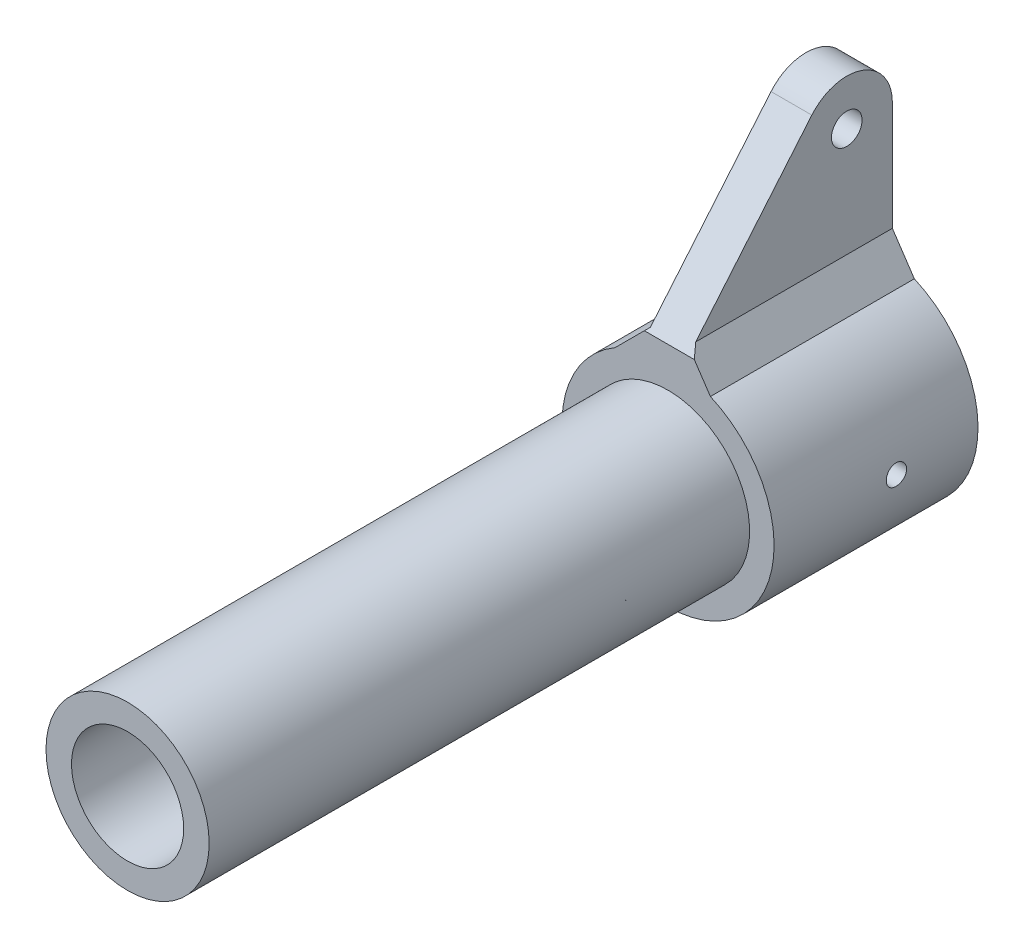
ISO-10303-21;
HEADER;
FILE_DESCRIPTION(('STEP AP214'),'2;1');
FILE_NAME('part.step','',(''),(''),'','','');
FILE_SCHEMA(('AUTOMOTIVE_DESIGN { 1 0 10303 214 1 1 1 1 }'));
ENDSEC;
DATA;
#1=APPLICATION_CONTEXT('core data for automotive mechanical design processes');
#2=APPLICATION_PROTOCOL_DEFINITION('international standard','automotive_design',2000,#1);
#3=PRODUCT_CONTEXT('',#1,'mechanical');
#4=PRODUCT('Part','Part','',(#3));
#5=PRODUCT_RELATED_PRODUCT_CATEGORY('part','',(#4));
#6=PRODUCT_DEFINITION_FORMATION('','',#4);
#7=PRODUCT_DEFINITION_CONTEXT('part definition',#1,'design');
#8=PRODUCT_DEFINITION('design','',#6,#7);
#9=PRODUCT_DEFINITION_SHAPE('','',#8);
#10=(LENGTH_UNIT() NAMED_UNIT(*) SI_UNIT(.MILLI.,.METRE.));
#11=(NAMED_UNIT(*) PLANE_ANGLE_UNIT() SI_UNIT($,.RADIAN.));
#12=(NAMED_UNIT(*) SI_UNIT($,.STERADIAN.) SOLID_ANGLE_UNIT());
#13=UNCERTAINTY_MEASURE_WITH_UNIT(LENGTH_MEASURE(1.E-05),#10,'distance_accuracy_value','');
#14=(GEOMETRIC_REPRESENTATION_CONTEXT(3) GLOBAL_UNCERTAINTY_ASSIGNED_CONTEXT((#13)) GLOBAL_UNIT_ASSIGNED_CONTEXT((#10,
#11,#12)) REPRESENTATION_CONTEXT('',''));
#15=CARTESIAN_POINT('',(0.,0.,0.));
#16=DIRECTION('',(0.,0.,1.));
#17=DIRECTION('',(1.,0.,0.));
#18=AXIS2_PLACEMENT_3D('',#15,#16,#17);
#19=CARTESIAN_POINT('',(0.,0.,10.));
#20=DIRECTION('',(0.,0.,-1.));
#21=DIRECTION('',(-1.,0.,0.));
#22=AXIS2_PLACEMENT_3D('',#19,#20,#21);
#23=CYLINDRICAL_SURFACE('',#22,5.2);
#24=CARTESIAN_POINT('',(-5.2,0.,4.5));
#25=CARTESIAN_POINT('',(-5.19999968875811,-0.0280158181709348,4.49999878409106));
#26=CARTESIAN_POINT('',(-5.19977118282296,-0.056050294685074,4.49763741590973));
#27=CARTESIAN_POINT('',(-5.19888159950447,-0.111342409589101,4.4882528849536));
#28=CARTESIAN_POINT('',(-5.1982200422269,-0.13859915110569,4.48122455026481));
#29=CARTESIAN_POINT('',(-5.19653905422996,-0.191527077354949,4.46271224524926));
#30=CARTESIAN_POINT('',(-5.19551983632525,-0.217199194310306,4.45123092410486));
#31=CARTESIAN_POINT('',(-5.19323757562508,-0.266246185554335,4.42414360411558));
#32=CARTESIAN_POINT('',(-5.19197458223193,-0.289621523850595,4.40853844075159));
#33=CARTESIAN_POINT('',(-5.18934159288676,-0.333495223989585,4.37359040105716));
#34=CARTESIAN_POINT('',(-5.18797129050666,-0.353984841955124,4.35423656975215));
#35=CARTESIAN_POINT('',(-5.18528066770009,-0.391430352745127,4.31236390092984));
#36=CARTESIAN_POINT('',(-5.18396034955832,-0.408386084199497,4.28984491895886));
#37=CARTESIAN_POINT('',(-5.18151601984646,-0.438313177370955,4.24222684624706));
#38=CARTESIAN_POINT('',(-5.18039239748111,-0.451276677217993,4.21712279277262));
#39=CARTESIAN_POINT('',(-5.17847241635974,-0.472801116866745,4.16508164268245));
#40=CARTESIAN_POINT('',(-5.17767605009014,-0.48136215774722,4.13814458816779));
#41=CARTESIAN_POINT('',(-5.17650347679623,-0.493812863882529,4.08329092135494));
#42=CARTESIAN_POINT('',(-5.17612597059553,-0.497716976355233,4.05537761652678));
#43=CARTESIAN_POINT('',(-5.17582981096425,-0.500787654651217,3.99928957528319));
#44=CARTESIAN_POINT('',(-5.17591114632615,-0.499954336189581,3.97111484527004));
#45=CARTESIAN_POINT('',(-5.17652229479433,-0.493585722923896,3.91540317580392));
#46=CARTESIAN_POINT('',(-5.17705060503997,-0.488066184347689,3.88786441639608));
#47=CARTESIAN_POINT('',(-5.17849382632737,-0.472506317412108,3.83410596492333));
#48=CARTESIAN_POINT('',(-5.17940874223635,-0.462465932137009,3.8078862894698));
#49=CARTESIAN_POINT('',(-5.18152381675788,-0.438131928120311,3.75746040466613));
#50=CARTESIAN_POINT('',(-5.1827244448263,-0.423831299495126,3.73325759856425));
#51=CARTESIAN_POINT('',(-5.18527525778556,-0.391387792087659,3.6875897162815));
#52=CARTESIAN_POINT('',(-5.18662544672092,-0.373244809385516,3.66612471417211));
#53=CARTESIAN_POINT('',(-5.18932994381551,-0.333543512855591,3.62645018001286));
#54=CARTESIAN_POINT('',(-5.19068424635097,-0.311971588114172,3.60825426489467));
#55=CARTESIAN_POINT('',(-5.19323917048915,-0.266072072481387,3.57573989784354));
#56=CARTESIAN_POINT('',(-5.19443979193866,-0.241744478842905,3.56142144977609));
#57=CARTESIAN_POINT('',(-5.19655242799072,-0.191014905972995,3.53706908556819));
#58=CARTESIAN_POINT('',(-5.19746439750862,-0.164612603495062,3.52703583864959));
#59=CARTESIAN_POINT('',(-5.19889650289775,-0.110487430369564,3.51154855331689));
#60=CARTESIAN_POINT('',(-5.19941664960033,-0.0827645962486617,3.50609438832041));
#61=CARTESIAN_POINT('',(-5.20000511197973,-0.0269032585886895,3.49993731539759));
#62=CARTESIAN_POINT('',(-5.20007521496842,0.00123315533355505,3.49921561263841));
#63=CARTESIAN_POINT('',(-5.19976047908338,0.0572265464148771,3.50249461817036));
#64=CARTESIAN_POINT('',(-5.19937564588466,0.0850835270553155,3.50649526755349));
#65=CARTESIAN_POINT('',(-5.19819543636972,0.139673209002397,3.51908982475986));
#66=CARTESIAN_POINT('',(-5.19740084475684,0.166407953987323,3.5276749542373));
#67=CARTESIAN_POINT('',(-5.19549028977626,0.218057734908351,3.54918576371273));
#68=CARTESIAN_POINT('',(-5.19437431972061,0.242972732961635,3.56211153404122));
#69=CARTESIAN_POINT('',(-5.19194144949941,0.290360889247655,3.59198347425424));
#70=CARTESIAN_POINT('',(-5.19062393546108,0.312826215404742,3.60894201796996));
#71=CARTESIAN_POINT('',(-5.18793785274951,0.354598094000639,3.6463803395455));
#72=CARTESIAN_POINT('',(-5.18656928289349,0.373904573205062,3.66686019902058));
#73=CARTESIAN_POINT('',(-5.18392997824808,0.40887578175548,3.71084170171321));
#74=CARTESIAN_POINT('',(-5.18265958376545,0.424528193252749,3.73435316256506));
#75=CARTESIAN_POINT('',(-5.18036556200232,0.4516623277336,3.78368193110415));
#76=CARTESIAN_POINT('',(-5.17934193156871,0.463144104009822,3.80949920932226));
#77=CARTESIAN_POINT('',(-5.17765941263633,0.481590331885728,3.8626641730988));
#78=CARTESIAN_POINT('',(-5.17699992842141,0.488562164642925,3.89000927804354));
#79=CARTESIAN_POINT('',(-5.17611848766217,0.497814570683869,3.94548863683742));
#80=CARTESIAN_POINT('',(-5.17589651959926,0.500095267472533,3.97362286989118));
#81=CARTESIAN_POINT('',(-5.17591546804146,0.499899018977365,4.02975943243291));
#82=CARTESIAN_POINT('',(-5.17615450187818,0.497441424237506,4.05776183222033));
#83=CARTESIAN_POINT('',(-5.17706451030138,0.487878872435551,4.11295405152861));
#84=CARTESIAN_POINT('',(-5.17773548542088,0.480773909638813,4.14014387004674));
#85=CARTESIAN_POINT('',(-5.1794332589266,0.462123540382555,4.19293930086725));
#86=CARTESIAN_POINT('',(-5.18046001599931,0.450578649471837,4.21854509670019));
#87=CARTESIAN_POINT('',(-5.18275374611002,0.423378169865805,4.26745848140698));
#88=CARTESIAN_POINT('',(-5.18402071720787,0.407722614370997,4.29076608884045));
#89=CARTESIAN_POINT('',(-5.18665830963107,0.372672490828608,4.33452063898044));
#90=CARTESIAN_POINT('',(-5.18802931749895,0.353263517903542,4.35495601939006));
#91=CARTESIAN_POINT('',(-5.19071696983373,0.311285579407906,4.39228858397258));
#92=CARTESIAN_POINT('',(-5.19203360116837,0.288715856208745,4.40918491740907));
#93=CARTESIAN_POINT('',(-5.19446732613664,0.240999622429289,4.43899048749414));
#94=CARTESIAN_POINT('',(-5.19558394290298,0.215847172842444,4.45189024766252));
#95=CARTESIAN_POINT('',(-5.1974865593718,0.163738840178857,4.47326620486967));
#96=CARTESIAN_POINT('',(-5.19827293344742,0.136785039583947,4.48174741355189));
#97=CARTESIAN_POINT('',(-5.19922781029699,0.0913975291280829,4.49191952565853));
#98=CARTESIAN_POINT('',(-5.19951603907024,0.0732544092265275,4.49494559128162));
#99=CARTESIAN_POINT('',(-5.1999022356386,0.0367435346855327,4.49898622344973));
#100=CARTESIAN_POINT('',(-5.20000020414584,0.0183757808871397,4.50000079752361));
#101=CARTESIAN_POINT('',(-5.2,0.,4.5));
#102=B_SPLINE_CURVE_WITH_KNOTS('',3,(#24,#25,#26,#27,#28,#29,#30,#31,#32,#33,#34,#35,#36,#37,
#38,#39,#40,#41,#42,#43,#44,#45,#46,#47,#48,#49,#50,#51,#52,#53,#54,#55,#56,#57,#58,#59,#60,#61,
#62,#63,#64,#65,#66,#67,#68,#69,#70,#71,#72,#73,#74,#75,#76,#77,#78,#79,#80,#81,#82,#83,#84,#85,
#86,#87,#88,#89,#90,#91,#92,#93,#94,#95,#96,#97,#98,#99,#100,#101),.UNSPECIFIED.,.T.,.F.,(4,2,2,
2,2,2,2,2,2,2,2,2,2,2,2,2,2,2,2,2,2,2,2,2,2,2,2,2,2,2,2,2,2,2,2,2,2,2,4),(0.,0.0839803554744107,
0.168053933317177,0.252077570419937,0.336084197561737,0.420340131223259,0.504599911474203,
0.589024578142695,0.673447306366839,0.757607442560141,0.841765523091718,0.925641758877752,
1.00951905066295,1.09353512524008,1.17755347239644,1.26191405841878,1.34627472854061,
1.43064856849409,1.51502007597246,1.59905630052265,1.68309147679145,1.7669663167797,
1.8508429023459,1.93498024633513,2.01911954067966,2.10353849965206,2.1879563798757,
2.2722357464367,2.3565128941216,2.44044659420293,2.52438039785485,2.60830445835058,
2.69222784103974,2.77647993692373,2.86075226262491,2.9452229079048,3.02959753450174,
3.08468107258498,3.13976440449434),.UNSPECIFIED.);
#103=CARTESIAN_POINT('',(-5.2,0.,4.5));
#104=VERTEX_POINT('',#103);
#105=EDGE_CURVE('E196',#104,#104,#102,.T.);
#106=ORIENTED_EDGE('',*,*,#105,.T.);
#107=EDGE_LOOP('',(#106));
#108=FACE_BOUND('',#107,.T.);
#109=CARTESIAN_POINT('',(0.,0.,10.));
#110=DIRECTION('',(0.,0.,-1.));
#111=DIRECTION('',(-1.,0.,0.));
#112=AXIS2_PLACEMENT_3D('',#109,#110,#111);
#113=CIRCLE('',#112,5.2);
#114=CARTESIAN_POINT('',(2.07809148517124,4.76671121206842,10.));
#115=VERTEX_POINT('',#114);
#116=CARTESIAN_POINT('',(-2.59907336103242,4.50386696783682,10.));
#117=VERTEX_POINT('',#116);
#118=EDGE_CURVE('E137',#115,#117,#113,.T.);
#119=ORIENTED_EDGE('',*,*,#118,.T.);
#120=DIRECTION('',(0.,0.,-1.));
#121=VECTOR('',#120,1.);
#122=CARTESIAN_POINT('',(-2.59907336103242,4.50386696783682,10.));
#123=LINE('',#122,#121);
#124=CARTESIAN_POINT('',(-2.59907336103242,4.50386696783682,0.));
#125=VERTEX_POINT('',#124);
#126=EDGE_CURVE('E162',#117,#125,#123,.T.);
#127=ORIENTED_EDGE('',*,*,#126,.T.);
#128=CARTESIAN_POINT('',(0.,0.,0.));
#129=DIRECTION('',(0.,0.,-1.));
#130=DIRECTION('',(-1.,0.,0.));
#131=AXIS2_PLACEMENT_3D('',#128,#129,#130);
#132=CIRCLE('',#131,5.2);
#133=CARTESIAN_POINT('',(2.07809148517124,4.76671121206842,0.));
#134=VERTEX_POINT('',#133);
#135=EDGE_CURVE('E135',#134,#125,#132,.T.);
#136=ORIENTED_EDGE('',*,*,#135,.F.);
#137=DIRECTION('',(0.,0.,-1.));
#138=VECTOR('',#137,1.);
#139=CARTESIAN_POINT('',(2.07809148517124,4.76671121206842,10.));
#140=LINE('',#139,#138);
#141=EDGE_CURVE('E160',#134,#115,#140,.F.);
#142=ORIENTED_EDGE('',*,*,#141,.T.);
#143=EDGE_LOOP('',(#119,#127,#136,#142));
#144=FACE_BOUND('',#143,.T.);
#145=CARTESIAN_POINT('',(5.2,0.,4.5));
#146=CARTESIAN_POINT('',(5.19999968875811,0.0280158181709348,4.49999878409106));
#147=CARTESIAN_POINT('',(5.19977118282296,0.056050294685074,4.49763741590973));
#148=CARTESIAN_POINT('',(5.19888159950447,0.111342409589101,4.4882528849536));
#149=CARTESIAN_POINT('',(5.1982200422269,0.13859915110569,4.48122455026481));
#150=CARTESIAN_POINT('',(5.19653905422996,0.191527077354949,4.46271224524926));
#151=CARTESIAN_POINT('',(5.19551983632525,0.217199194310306,4.45123092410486));
#152=CARTESIAN_POINT('',(5.19323757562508,0.266246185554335,4.42414360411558));
#153=CARTESIAN_POINT('',(5.19197458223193,0.289621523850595,4.40853844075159));
#154=CARTESIAN_POINT('',(5.18934159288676,0.333495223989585,4.37359040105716));
#155=CARTESIAN_POINT('',(5.18797129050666,0.353984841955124,4.35423656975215));
#156=CARTESIAN_POINT('',(5.18528066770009,0.391430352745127,4.31236390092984));
#157=CARTESIAN_POINT('',(5.18396034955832,0.408386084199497,4.28984491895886));
#158=CARTESIAN_POINT('',(5.18151601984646,0.438313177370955,4.24222684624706));
#159=CARTESIAN_POINT('',(5.18039239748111,0.451276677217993,4.21712279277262));
#160=CARTESIAN_POINT('',(5.17847241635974,0.472801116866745,4.16508164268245));
#161=CARTESIAN_POINT('',(5.17767605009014,0.48136215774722,4.13814458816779));
#162=CARTESIAN_POINT('',(5.17650347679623,0.493812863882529,4.08329092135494));
#163=CARTESIAN_POINT('',(5.17612597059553,0.497716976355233,4.05537761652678));
#164=CARTESIAN_POINT('',(5.17582981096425,0.500787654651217,3.99928957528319));
#165=CARTESIAN_POINT('',(5.17591114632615,0.499954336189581,3.97111484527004));
#166=CARTESIAN_POINT('',(5.17652229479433,0.493585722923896,3.91540317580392));
#167=CARTESIAN_POINT('',(5.17705060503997,0.488066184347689,3.88786441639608));
#168=CARTESIAN_POINT('',(5.17849382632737,0.472506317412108,3.83410596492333));
#169=CARTESIAN_POINT('',(5.17940874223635,0.462465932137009,3.8078862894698));
#170=CARTESIAN_POINT('',(5.18152381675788,0.438131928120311,3.75746040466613));
#171=CARTESIAN_POINT('',(5.1827244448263,0.423831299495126,3.73325759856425));
#172=CARTESIAN_POINT('',(5.18527525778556,0.391387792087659,3.6875897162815));
#173=CARTESIAN_POINT('',(5.18662544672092,0.373244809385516,3.66612471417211));
#174=CARTESIAN_POINT('',(5.18932994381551,0.333543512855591,3.62645018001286));
#175=CARTESIAN_POINT('',(5.19068424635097,0.311971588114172,3.60825426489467));
#176=CARTESIAN_POINT('',(5.19323917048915,0.266072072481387,3.57573989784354));
#177=CARTESIAN_POINT('',(5.19443979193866,0.241744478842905,3.56142144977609));
#178=CARTESIAN_POINT('',(5.19655242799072,0.191014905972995,3.53706908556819));
#179=CARTESIAN_POINT('',(5.19746439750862,0.164612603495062,3.52703583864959));
#180=CARTESIAN_POINT('',(5.19889650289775,0.110487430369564,3.51154855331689));
#181=CARTESIAN_POINT('',(5.19941664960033,0.0827645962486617,3.50609438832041));
#182=CARTESIAN_POINT('',(5.20000511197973,0.0269032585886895,3.49993731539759));
#183=CARTESIAN_POINT('',(5.20007521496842,-0.00123315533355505,3.49921561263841));
#184=CARTESIAN_POINT('',(5.19976047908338,-0.0572265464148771,3.50249461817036));
#185=CARTESIAN_POINT('',(5.19937564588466,-0.0850835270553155,3.50649526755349));
#186=CARTESIAN_POINT('',(5.19819543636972,-0.139673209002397,3.51908982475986));
#187=CARTESIAN_POINT('',(5.19740084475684,-0.166407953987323,3.5276749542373));
#188=CARTESIAN_POINT('',(5.19549028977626,-0.218057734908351,3.54918576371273));
#189=CARTESIAN_POINT('',(5.19437431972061,-0.242972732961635,3.56211153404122));
#190=CARTESIAN_POINT('',(5.19194144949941,-0.290360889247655,3.59198347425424));
#191=CARTESIAN_POINT('',(5.19062393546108,-0.312826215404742,3.60894201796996));
#192=CARTESIAN_POINT('',(5.18793785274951,-0.354598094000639,3.6463803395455));
#193=CARTESIAN_POINT('',(5.18656928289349,-0.373904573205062,3.66686019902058));
#194=CARTESIAN_POINT('',(5.18392997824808,-0.40887578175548,3.71084170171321));
#195=CARTESIAN_POINT('',(5.18265958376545,-0.424528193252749,3.73435316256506));
#196=CARTESIAN_POINT('',(5.18036556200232,-0.4516623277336,3.78368193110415));
#197=CARTESIAN_POINT('',(5.17934193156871,-0.463144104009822,3.80949920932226));
#198=CARTESIAN_POINT('',(5.17765941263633,-0.481590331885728,3.8626641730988));
#199=CARTESIAN_POINT('',(5.17699992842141,-0.488562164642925,3.89000927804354));
#200=CARTESIAN_POINT('',(5.17611848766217,-0.497814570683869,3.94548863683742));
#201=CARTESIAN_POINT('',(5.17589651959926,-0.500095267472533,3.97362286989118));
#202=CARTESIAN_POINT('',(5.17591546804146,-0.499899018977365,4.02975943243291));
#203=CARTESIAN_POINT('',(5.17615450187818,-0.497441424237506,4.05776183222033));
#204=CARTESIAN_POINT('',(5.17706451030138,-0.487878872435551,4.11295405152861));
#205=CARTESIAN_POINT('',(5.17773548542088,-0.480773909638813,4.14014387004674));
#206=CARTESIAN_POINT('',(5.1794332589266,-0.462123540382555,4.19293930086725));
#207=CARTESIAN_POINT('',(5.18046001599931,-0.450578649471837,4.21854509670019));
#208=CARTESIAN_POINT('',(5.18275374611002,-0.423378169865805,4.26745848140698));
#209=CARTESIAN_POINT('',(5.18402071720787,-0.407722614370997,4.29076608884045));
#210=CARTESIAN_POINT('',(5.18665830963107,-0.372672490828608,4.33452063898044));
#211=CARTESIAN_POINT('',(5.18802931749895,-0.353263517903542,4.35495601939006));
#212=CARTESIAN_POINT('',(5.19071696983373,-0.311285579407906,4.39228858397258));
#213=CARTESIAN_POINT('',(5.19203360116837,-0.288715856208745,4.40918491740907));
#214=CARTESIAN_POINT('',(5.19446732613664,-0.240999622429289,4.43899048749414));
#215=CARTESIAN_POINT('',(5.19558394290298,-0.215847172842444,4.45189024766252));
#216=CARTESIAN_POINT('',(5.1974865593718,-0.163738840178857,4.47326620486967));
#217=CARTESIAN_POINT('',(5.19827293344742,-0.136785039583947,4.48174741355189));
#218=CARTESIAN_POINT('',(5.19922781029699,-0.0913975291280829,4.49191952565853));
#219=CARTESIAN_POINT('',(5.19951603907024,-0.0732544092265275,4.49494559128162));
#220=CARTESIAN_POINT('',(5.1999022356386,-0.0367435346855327,4.49898622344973));
#221=CARTESIAN_POINT('',(5.20000020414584,-0.0183757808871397,4.50000079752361));
#222=CARTESIAN_POINT('',(5.2,0.,4.5));
#223=B_SPLINE_CURVE_WITH_KNOTS('',3,(#145,#146,#147,#148,#149,#150,#151,#152,#153,#154,#155,
#156,#157,#158,#159,#160,#161,#162,#163,#164,#165,#166,#167,#168,#169,#170,#171,#172,#173,#174,
#175,#176,#177,#178,#179,#180,#181,#182,#183,#184,#185,#186,#187,#188,#189,#190,#191,#192,#193,
#194,#195,#196,#197,#198,#199,#200,#201,#202,#203,#204,#205,#206,#207,#208,#209,#210,#211,#212,
#213,#214,#215,#216,#217,#218,#219,#220,#221,#222),.UNSPECIFIED.,.T.,.F.,(4,2,2,2,2,2,2,2,2,2,2,
2,2,2,2,2,2,2,2,2,2,2,2,2,2,2,2,2,2,2,2,2,2,2,2,2,2,2,4),(0.,0.0839803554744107,
0.168053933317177,0.252077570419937,0.336084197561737,0.420340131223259,0.504599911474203,
0.589024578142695,0.673447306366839,0.757607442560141,0.841765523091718,0.925641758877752,
1.00951905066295,1.09353512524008,1.17755347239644,1.26191405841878,1.34627472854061,
1.43064856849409,1.51502007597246,1.59905630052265,1.68309147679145,1.7669663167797,
1.8508429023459,1.93498024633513,2.01911954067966,2.10353849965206,2.1879563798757,
2.2722357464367,2.3565128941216,2.44044659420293,2.52438039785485,2.60830445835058,
2.69222784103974,2.77647993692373,2.86075226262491,2.9452229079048,3.02959753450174,
3.08468107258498,3.13976440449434),.UNSPECIFIED.);
#224=CARTESIAN_POINT('',(5.2,0.,4.5));
#225=VERTEX_POINT('',#224);
#226=EDGE_CURVE('E201',#225,#225,#223,.T.);
#227=ORIENTED_EDGE('',*,*,#226,.T.);
#228=EDGE_LOOP('',(#227));
#229=FACE_BOUND('',#228,.T.);
#230=ADVANCED_FACE('F33',(#108,#144,#229),#23,.T.);
#231=CARTESIAN_POINT('',(0.,0.,36.5));
#232=DIRECTION('',(0.,0.,-1.));
#233=DIRECTION('',(-1.,0.,0.));
#234=AXIS2_PLACEMENT_3D('',#231,#232,#233);
#235=CYLINDRICAL_SURFACE('',#234,2.75);
#236=CARTESIAN_POINT('',(2.75,0.,4.5));
#237=CARTESIAN_POINT('',(2.74999950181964,-0.0278393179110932,4.49999892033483));
#238=CARTESIAN_POINT('',(2.74957288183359,-0.0556928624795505,4.49766706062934));
#239=CARTESIAN_POINT('',(2.74791211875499,-0.110616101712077,4.48840663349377));
#240=CARTESIAN_POINT('',(2.74667727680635,-0.137685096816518,4.48147408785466));
#241=CARTESIAN_POINT('',(2.74353830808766,-0.190236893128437,4.46323071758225));
#242=CARTESIAN_POINT('',(2.7416347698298,-0.215721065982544,4.45192374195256));
#243=CARTESIAN_POINT('',(2.73736667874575,-0.264428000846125,4.42526316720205));
#244=CARTESIAN_POINT('',(2.7350021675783,-0.287650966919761,4.40990993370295));
#245=CARTESIAN_POINT('',(2.73004358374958,-0.331441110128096,4.37540852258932));
#246=CARTESIAN_POINT('',(2.7274474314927,-0.351979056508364,4.35622353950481));
#247=CARTESIAN_POINT('',(2.72233373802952,-0.389563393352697,4.31468241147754));
#248=CARTESIAN_POINT('',(2.71981620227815,-0.406609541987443,4.29232604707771));
#249=CARTESIAN_POINT('',(2.71512460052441,-0.436846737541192,4.24487181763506));
#250=CARTESIAN_POINT('',(2.71295321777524,-0.450008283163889,4.21975486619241));
#251=CARTESIAN_POINT('',(2.70922895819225,-0.471913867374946,4.16762033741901));
#252=CARTESIAN_POINT('',(2.70767603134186,-0.480658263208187,4.14060291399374));
#253=CARTESIAN_POINT('',(2.70538538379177,-0.493387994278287,4.08574633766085));
#254=CARTESIAN_POINT('',(2.70463896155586,-0.497424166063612,4.05791935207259));
#255=CARTESIAN_POINT('',(2.70401957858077,-0.500780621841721,4.00197389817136));
#256=CARTESIAN_POINT('',(2.70414654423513,-0.500101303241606,3.97385545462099));
#257=CARTESIAN_POINT('',(2.70525166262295,-0.4940873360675,3.91849202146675));
#258=CARTESIAN_POINT('',(2.70621928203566,-0.48881029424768,3.89124053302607));
#259=CARTESIAN_POINT('',(2.70888015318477,-0.473841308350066,3.83801624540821));
#260=CARTESIAN_POINT('',(2.71057343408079,-0.46414918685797,3.81204349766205));
#261=CARTESIAN_POINT('',(2.71450595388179,-0.440568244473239,3.76194430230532));
#262=CARTESIAN_POINT('',(2.71674822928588,-0.426655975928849,3.73782913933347));
#263=CARTESIAN_POINT('',(2.72152405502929,-0.395046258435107,3.69225381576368));
#264=CARTESIAN_POINT('',(2.72405763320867,-0.377348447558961,3.67079390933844));
#265=CARTESIAN_POINT('',(2.72917660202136,-0.338358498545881,3.63080525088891));
#266=CARTESIAN_POINT('',(2.73176220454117,-0.317017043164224,3.61232457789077));
#267=CARTESIAN_POINT('',(2.73665937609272,-0.271511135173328,3.57919871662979));
#268=CARTESIAN_POINT('',(2.7389709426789,-0.247346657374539,3.56455356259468));
#269=CARTESIAN_POINT('',(2.74306384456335,-0.196831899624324,3.53950815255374));
#270=CARTESIAN_POINT('',(2.74484458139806,-0.170479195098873,3.52911268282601));
#271=CARTESIAN_POINT('',(2.74767051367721,-0.116362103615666,3.51290920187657));
#272=CARTESIAN_POINT('',(2.74871578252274,-0.0885978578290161,3.50710073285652));
#273=CARTESIAN_POINT('',(2.74994298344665,-0.0328596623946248,3.50030255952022));
#274=CARTESIAN_POINT('',(2.75013672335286,-0.00489400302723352,3.49924694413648));
#275=CARTESIAN_POINT('',(2.74967157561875,0.0508143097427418,3.50180794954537));
#276=CARTESIAN_POINT('',(2.74901272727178,0.0785569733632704,3.50542435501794));
#277=CARTESIAN_POINT('',(2.74692377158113,0.132824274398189,3.51717193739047));
#278=CARTESIAN_POINT('',(2.7454993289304,0.159356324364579,3.52526996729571));
#279=CARTESIAN_POINT('',(2.74203823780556,0.210686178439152,3.54571520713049));
#280=CARTESIAN_POINT('',(2.74000154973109,0.235483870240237,3.55806269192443));
#281=CARTESIAN_POINT('',(2.7355124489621,0.282923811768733,3.58680365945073));
#282=CARTESIAN_POINT('',(2.7330559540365,0.30554111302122,3.60323767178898));
#283=CARTESIAN_POINT('',(2.72801072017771,0.347720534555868,3.63963009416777));
#284=CARTESIAN_POINT('',(2.72542196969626,0.36728238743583,3.65958881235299));
#285=CARTESIAN_POINT('',(2.72036509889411,0.403044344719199,3.70276172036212));
#286=CARTESIAN_POINT('',(2.71789888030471,0.419199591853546,3.72601332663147));
#287=CARTESIAN_POINT('',(2.71340377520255,0.447374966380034,3.77493904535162));
#288=CARTESIAN_POINT('',(2.71137487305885,0.459395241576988,3.8006130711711));
#289=CARTESIAN_POINT('',(2.70799886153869,0.478894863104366,3.85353768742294));
#290=CARTESIAN_POINT('',(2.70664859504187,0.4863952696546,3.88078030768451));
#291=CARTESIAN_POINT('',(2.70477531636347,0.496707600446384,3.93616574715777));
#292=CARTESIAN_POINT('',(2.7042522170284,0.499520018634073,3.96430847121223));
#293=CARTESIAN_POINT('',(2.70409673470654,0.50036078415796,4.02024634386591));
#294=CARTESIAN_POINT('',(2.70445118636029,0.498459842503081,4.04804041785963));
#295=CARTESIAN_POINT('',(2.70598177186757,0.490082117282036,4.10290590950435));
#296=CARTESIAN_POINT('',(2.70715790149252,0.483605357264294,4.12997733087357));
#297=CARTESIAN_POINT('',(2.71019393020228,0.466288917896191,4.18259404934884));
#298=CARTESIAN_POINT('',(2.71205269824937,0.45545645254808,4.20814179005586));
#299=CARTESIAN_POINT('',(2.71624544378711,0.429743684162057,4.25706861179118));
#300=CARTESIAN_POINT('',(2.71857945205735,0.414863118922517,4.2804475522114));
#301=CARTESIAN_POINT('',(2.72350081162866,0.381228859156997,4.32472821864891));
#302=CARTESIAN_POINT('',(2.72609126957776,0.362423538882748,4.34559039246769));
#303=CARTESIAN_POINT('',(2.73120998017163,0.321581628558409,4.38388677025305));
#304=CARTESIAN_POINT('',(2.73373821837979,0.299544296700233,4.40132018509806));
#305=CARTESIAN_POINT('',(2.73847243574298,0.252642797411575,4.43240007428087));
#306=CARTESIAN_POINT('',(2.74067553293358,0.227756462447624,4.44601354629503));
#307=CARTESIAN_POINT('',(2.74448315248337,0.176018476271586,4.46884480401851));
#308=CARTESIAN_POINT('',(2.74608824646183,0.149168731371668,4.47806678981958));
#309=CARTESIAN_POINT('',(2.74818517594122,0.101860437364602,4.48994385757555));
#310=CARTESIAN_POINT('',(2.74886195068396,0.0816813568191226,4.49370858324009));
#311=CARTESIAN_POINT('',(2.74976954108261,0.0410040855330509,4.49873702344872));
#312=CARTESIAN_POINT('',(2.75000036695,0.0205059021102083,4.50000079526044));
#313=CARTESIAN_POINT('',(2.75,0.,4.5));
#314=B_SPLINE_CURVE_WITH_KNOTS('',3,(#236,#237,#238,#239,#240,#241,#242,#243,#244,#245,#246,
#247,#248,#249,#250,#251,#252,#253,#254,#255,#256,#257,#258,#259,#260,#261,#262,#263,#264,#265,
#266,#267,#268,#269,#270,#271,#272,#273,#274,#275,#276,#277,#278,#279,#280,#281,#282,#283,#284,
#285,#286,#287,#288,#289,#290,#291,#292,#293,#294,#295,#296,#297,#298,#299,#300,#301,#302,#303,
#304,#305,#306,#307,#308,#309,#310,#311,#312,#313),.UNSPECIFIED.,.T.,.F.,(4,2,2,2,2,2,2,2,2,2,2,
2,2,2,2,2,2,2,2,2,2,2,2,2,2,2,2,2,2,2,2,2,2,2,2,2,2,2,4),(0.,0.0834429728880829,
0.166958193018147,0.250400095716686,0.333834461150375,0.418112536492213,0.502396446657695,
0.587304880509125,0.672206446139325,0.756182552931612,0.840151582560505,0.923083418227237,
1.00601858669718,1.08942326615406,1.17283592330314,1.25748302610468,1.34213088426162,
1.42687381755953,1.51160829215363,1.59516400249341,1.67871586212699,1.76165785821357,
1.84460522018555,1.92841056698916,2.01222324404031,2.09707876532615,2.18193125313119,
2.26638525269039,2.350830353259,2.43401627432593,2.51720176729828,2.6002500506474,
2.68330371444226,2.7675277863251,2.85177121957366,2.93672151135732,3.02159039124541,
3.0830542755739,3.14451675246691),.UNSPECIFIED.);
#315=CARTESIAN_POINT('',(2.75,0.,4.5));
#316=VERTEX_POINT('',#315);
#317=EDGE_CURVE('E176',#316,#316,#314,.T.);
#318=ORIENTED_EDGE('',*,*,#317,.T.);
#319=EDGE_LOOP('',(#318));
#320=FACE_BOUND('',#319,.T.);
#321=CARTESIAN_POINT('',(0.,0.,36.5));
#322=DIRECTION('',(0.,0.,1.));
#323=DIRECTION('',(1.,0.,0.));
#324=AXIS2_PLACEMENT_3D('',#321,#322,#323);
#325=CIRCLE('',#324,2.75);
#326=CARTESIAN_POINT('',(2.75,0.,36.5));
#327=VERTEX_POINT('',#326);
#328=EDGE_CURVE('E151',#327,#327,#325,.T.);
#329=ORIENTED_EDGE('',*,*,#328,.T.);
#330=EDGE_LOOP('',(#329));
#331=FACE_BOUND('',#330,.T.);
#332=CARTESIAN_POINT('',(0.,0.,1.5));
#333=DIRECTION('',(0.,0.,-1.));
#334=DIRECTION('',(-1.,0.,0.));
#335=AXIS2_PLACEMENT_3D('',#332,#333,#334);
#336=CIRCLE('',#335,2.75);
#337=CARTESIAN_POINT('',(-2.75,0.,1.5));
#338=VERTEX_POINT('',#337);
#339=EDGE_CURVE('E146',#338,#338,#336,.T.);
#340=ORIENTED_EDGE('',*,*,#339,.T.);
#341=EDGE_LOOP('',(#340));
#342=FACE_BOUND('',#341,.T.);
#343=CARTESIAN_POINT('',(-2.75,0.,4.5));
#344=CARTESIAN_POINT('',(-2.74999950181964,0.0278393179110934,4.49999892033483));
#345=CARTESIAN_POINT('',(-2.74957288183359,0.055692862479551,4.49766706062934));
#346=CARTESIAN_POINT('',(-2.74791211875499,0.110616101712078,4.48840663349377));
#347=CARTESIAN_POINT('',(-2.74667727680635,0.137685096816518,4.48147408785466));
#348=CARTESIAN_POINT('',(-2.74353830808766,0.190236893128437,4.46323071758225));
#349=CARTESIAN_POINT('',(-2.7416347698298,0.215721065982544,4.45192374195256));
#350=CARTESIAN_POINT('',(-2.73736667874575,0.264428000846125,4.42526316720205));
#351=CARTESIAN_POINT('',(-2.7350021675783,0.287650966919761,4.40990993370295));
#352=CARTESIAN_POINT('',(-2.73004358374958,0.331441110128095,4.37540852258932));
#353=CARTESIAN_POINT('',(-2.7274474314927,0.351979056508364,4.35622353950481));
#354=CARTESIAN_POINT('',(-2.72233373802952,0.389563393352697,4.31468241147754));
#355=CARTESIAN_POINT('',(-2.71981620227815,0.406609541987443,4.29232604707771));
#356=CARTESIAN_POINT('',(-2.71512460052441,0.436846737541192,4.24487181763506));
#357=CARTESIAN_POINT('',(-2.71295321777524,0.450008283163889,4.21975486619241));
#358=CARTESIAN_POINT('',(-2.70922895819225,0.471913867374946,4.16762033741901));
#359=CARTESIAN_POINT('',(-2.70767603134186,0.480658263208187,4.14060291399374));
#360=CARTESIAN_POINT('',(-2.70538538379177,0.493387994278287,4.08574633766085));
#361=CARTESIAN_POINT('',(-2.70463896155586,0.497424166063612,4.05791935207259));
#362=CARTESIAN_POINT('',(-2.70401957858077,0.500780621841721,4.00197389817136));
#363=CARTESIAN_POINT('',(-2.70414654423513,0.500101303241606,3.97385545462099));
#364=CARTESIAN_POINT('',(-2.70525166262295,0.4940873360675,3.91849202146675));
#365=CARTESIAN_POINT('',(-2.70621928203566,0.48881029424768,3.89124053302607));
#366=CARTESIAN_POINT('',(-2.70888015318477,0.473841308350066,3.83801624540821));
#367=CARTESIAN_POINT('',(-2.71057343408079,0.46414918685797,3.81204349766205));
#368=CARTESIAN_POINT('',(-2.71450595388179,0.440568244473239,3.76194430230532));
#369=CARTESIAN_POINT('',(-2.71674822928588,0.426655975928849,3.73782913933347));
#370=CARTESIAN_POINT('',(-2.72152405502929,0.395046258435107,3.69225381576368));
#371=CARTESIAN_POINT('',(-2.72405763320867,0.377348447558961,3.67079390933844));
#372=CARTESIAN_POINT('',(-2.72917660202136,0.338358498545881,3.63080525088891));
#373=CARTESIAN_POINT('',(-2.73176220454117,0.317017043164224,3.61232457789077));
#374=CARTESIAN_POINT('',(-2.73665937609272,0.271511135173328,3.57919871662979));
#375=CARTESIAN_POINT('',(-2.7389709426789,0.24734665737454,3.56455356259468));
#376=CARTESIAN_POINT('',(-2.74306384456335,0.196831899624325,3.53950815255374));
#377=CARTESIAN_POINT('',(-2.74484458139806,0.170479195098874,3.52911268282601));
#378=CARTESIAN_POINT('',(-2.74767051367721,0.116362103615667,3.51290920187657));
#379=CARTESIAN_POINT('',(-2.74871578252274,0.0885978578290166,3.50710073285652));
#380=CARTESIAN_POINT('',(-2.74994298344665,0.032859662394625,3.50030255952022));
#381=CARTESIAN_POINT('',(-2.75013672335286,0.00489400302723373,3.49924694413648));
#382=CARTESIAN_POINT('',(-2.74967157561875,-0.0508143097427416,3.50180794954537));
#383=CARTESIAN_POINT('',(-2.74901272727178,-0.0785569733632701,3.50542435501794));
#384=CARTESIAN_POINT('',(-2.74692377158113,-0.132824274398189,3.51717193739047));
#385=CARTESIAN_POINT('',(-2.7454993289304,-0.159356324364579,3.52526996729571));
#386=CARTESIAN_POINT('',(-2.74203823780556,-0.210686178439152,3.54571520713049));
#387=CARTESIAN_POINT('',(-2.74000154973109,-0.235483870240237,3.55806269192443));
#388=CARTESIAN_POINT('',(-2.7355124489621,-0.282923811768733,3.58680365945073));
#389=CARTESIAN_POINT('',(-2.7330559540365,-0.30554111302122,3.60323767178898));
#390=CARTESIAN_POINT('',(-2.72801072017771,-0.347720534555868,3.63963009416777));
#391=CARTESIAN_POINT('',(-2.72542196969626,-0.36728238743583,3.65958881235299));
#392=CARTESIAN_POINT('',(-2.72036509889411,-0.403044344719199,3.70276172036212));
#393=CARTESIAN_POINT('',(-2.71789888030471,-0.419199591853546,3.72601332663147));
#394=CARTESIAN_POINT('',(-2.71340377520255,-0.447374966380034,3.77493904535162));
#395=CARTESIAN_POINT('',(-2.71137487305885,-0.459395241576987,3.8006130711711));
#396=CARTESIAN_POINT('',(-2.70799886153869,-0.478894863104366,3.85353768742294));
#397=CARTESIAN_POINT('',(-2.70664859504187,-0.486395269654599,3.88078030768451));
#398=CARTESIAN_POINT('',(-2.70477531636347,-0.496707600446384,3.93616574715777));
#399=CARTESIAN_POINT('',(-2.7042522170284,-0.499520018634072,3.96430847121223));
#400=CARTESIAN_POINT('',(-2.70409673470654,-0.50036078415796,4.02024634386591));
#401=CARTESIAN_POINT('',(-2.70445118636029,-0.498459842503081,4.04804041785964));
#402=CARTESIAN_POINT('',(-2.70598177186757,-0.490082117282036,4.10290590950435));
#403=CARTESIAN_POINT('',(-2.70715790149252,-0.483605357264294,4.12997733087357));
#404=CARTESIAN_POINT('',(-2.71019393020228,-0.466288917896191,4.18259404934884));
#405=CARTESIAN_POINT('',(-2.71205269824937,-0.45545645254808,4.20814179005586));
#406=CARTESIAN_POINT('',(-2.71624544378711,-0.429743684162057,4.25706861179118));
#407=CARTESIAN_POINT('',(-2.71857945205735,-0.414863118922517,4.2804475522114));
#408=CARTESIAN_POINT('',(-2.72350081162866,-0.381228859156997,4.32472821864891));
#409=CARTESIAN_POINT('',(-2.72609126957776,-0.362423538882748,4.34559039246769));
#410=CARTESIAN_POINT('',(-2.73120998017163,-0.32158162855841,4.38388677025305));
#411=CARTESIAN_POINT('',(-2.73373821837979,-0.299544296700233,4.40132018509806));
#412=CARTESIAN_POINT('',(-2.73847243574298,-0.252642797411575,4.43240007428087));
#413=CARTESIAN_POINT('',(-2.74067553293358,-0.227756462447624,4.44601354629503));
#414=CARTESIAN_POINT('',(-2.74448315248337,-0.176018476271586,4.46884480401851));
#415=CARTESIAN_POINT('',(-2.74608824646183,-0.149168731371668,4.47806678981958));
#416=CARTESIAN_POINT('',(-2.74818517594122,-0.101860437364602,4.48994385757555));
#417=CARTESIAN_POINT('',(-2.74886195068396,-0.0816813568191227,4.49370858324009));
#418=CARTESIAN_POINT('',(-2.74976954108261,-0.041004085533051,4.49873702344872));
#419=CARTESIAN_POINT('',(-2.75000036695,-0.0205059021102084,4.50000079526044));
#420=CARTESIAN_POINT('',(-2.75,0.,4.5));
#421=B_SPLINE_CURVE_WITH_KNOTS('',3,(#343,#344,#345,#346,#347,#348,#349,#350,#351,#352,#353,
#354,#355,#356,#357,#358,#359,#360,#361,#362,#363,#364,#365,#366,#367,#368,#369,#370,#371,#372,
#373,#374,#375,#376,#377,#378,#379,#380,#381,#382,#383,#384,#385,#386,#387,#388,#389,#390,#391,
#392,#393,#394,#395,#396,#397,#398,#399,#400,#401,#402,#403,#404,#405,#406,#407,#408,#409,#410,
#411,#412,#413,#414,#415,#416,#417,#418,#419,#420),.UNSPECIFIED.,.T.,.F.,(4,2,2,2,2,2,2,2,2,2,2,
2,2,2,2,2,2,2,2,2,2,2,2,2,2,2,2,2,2,2,2,2,2,2,2,2,2,2,4),(0.,0.0834429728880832,
0.166958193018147,0.250400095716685,0.333834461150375,0.418112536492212,0.502396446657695,
0.587304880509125,0.672206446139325,0.756182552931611,0.840151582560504,0.923083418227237,
1.00601858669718,1.08942326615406,1.17283592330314,1.25748302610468,1.34213088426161,
1.42687381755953,1.51160829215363,1.59516400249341,1.67871586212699,1.76165785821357,
1.84460522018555,1.92841056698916,2.01222324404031,2.09707876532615,2.18193125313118,
2.26638525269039,2.350830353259,2.43401627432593,2.51720176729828,2.6002500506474,
2.68330371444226,2.76752778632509,2.85177121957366,2.93672151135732,3.02159039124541,
3.0830542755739,3.14451675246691),.UNSPECIFIED.);
#422=CARTESIAN_POINT('',(-2.75,0.,4.5));
#423=VERTEX_POINT('',#422);
#424=EDGE_CURVE('E37',#423,#423,#421,.T.);
#425=ORIENTED_EDGE('',*,*,#424,.T.);
#426=EDGE_LOOP('',(#425));
#427=FACE_BOUND('',#426,.T.);
#428=ADVANCED_FACE('F180',(#320,#331,#342,#427),#235,.F.);
#429=CARTESIAN_POINT('',(0.,0.,36.5));
#430=DIRECTION('',(0.,0.,-1.));
#431=DIRECTION('',(-1.,0.,0.));
#432=AXIS2_PLACEMENT_3D('',#429,#430,#431);
#433=CYLINDRICAL_SURFACE('',#432,4.);
#434=CARTESIAN_POINT('',(0.,0.,36.5));
#435=DIRECTION('',(0.,0.,1.));
#436=DIRECTION('',(1.,0.,0.));
#437=AXIS2_PLACEMENT_3D('',#434,#435,#436);
#438=CIRCLE('',#437,4.);
#439=CARTESIAN_POINT('',(4.,0.,36.5));
#440=VERTEX_POINT('',#439);
#441=EDGE_CURVE('E154',#440,#440,#438,.T.);
#442=ORIENTED_EDGE('',*,*,#441,.F.);
#443=EDGE_LOOP('',(#442));
#444=FACE_BOUND('',#443,.T.);
#445=CARTESIAN_POINT('',(0.,0.,10.));
#446=DIRECTION('',(0.,0.,-1.));
#447=DIRECTION('',(-1.,0.,0.));
#448=AXIS2_PLACEMENT_3D('',#445,#446,#447);
#449=CIRCLE('',#448,4.);
#450=CARTESIAN_POINT('',(-4.,0.,10.));
#451=VERTEX_POINT('',#450);
#452=EDGE_CURVE('E157',#451,#451,#449,.T.);
#453=ORIENTED_EDGE('',*,*,#452,.F.);
#454=EDGE_LOOP('',(#453));
#455=FACE_BOUND('',#454,.T.);
#456=ADVANCED_FACE('F229',(#444,#455),#433,.T.);
#457=CARTESIAN_POINT('',(0.,0.,36.5));
#458=DIRECTION('',(0.,0.,1.));
#459=DIRECTION('',(1.,0.,0.));
#460=AXIS2_PLACEMENT_3D('',#457,#458,#459);
#461=PLANE('',#460);
#462=ORIENTED_EDGE('',*,*,#441,.T.);
#463=EDGE_LOOP('',(#462));
#464=FACE_BOUND('',#463,.T.);
#465=ORIENTED_EDGE('',*,*,#328,.F.);
#466=EDGE_LOOP('',(#465));
#467=FACE_BOUND('',#466,.T.);
#468=ADVANCED_FACE('F221',(#464,#467),#461,.T.);
#469=CARTESIAN_POINT('',(0.,0.,0.));
#470=DIRECTION('',(0.,0.,1.));
#471=DIRECTION('',(1.,0.,0.));
#472=AXIS2_PLACEMENT_3D('',#469,#470,#471);
#473=PLANE('',#472);
#474=DIRECTION('',(0.,1.,0.));
#475=VECTOR('',#474,1.);
#476=CARTESIAN_POINT('',(1.,3.24857751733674,0.));
#477=LINE('',#476,#475);
#478=CARTESIAN_POINT('',(1.,6.37032410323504,0.));
#479=VERTEX_POINT('',#478);
#480=CARTESIAN_POINT('',(1.,11.7157137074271,0.));
#481=VERTEX_POINT('',#480);
#482=EDGE_CURVE('E95',#479,#481,#477,.T.);
#483=ORIENTED_EDGE('',*,*,#482,.F.);
#484=DIRECTION('',(0.557926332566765,-0.829890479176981,0.));
#485=VECTOR('',#484,1.);
#486=CARTESIAN_POINT('',(3.6382913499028,2.4459836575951,0.));
#487=LINE('',#486,#485);
#488=EDGE_CURVE('E174',#479,#134,#487,.T.);
#489=ORIENTED_EDGE('',*,*,#488,.T.);
#490=ORIENTED_EDGE('',*,*,#135,.T.);
#491=DIRECTION('',(0.707106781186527,0.707106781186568,0.));
#492=VECTOR('',#491,1.);
#493=CARTESIAN_POINT('',(-3.5514701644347,3.55147016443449,0.));
#494=LINE('',#493,#492);
#495=CARTESIAN_POINT('',(-1.,6.10294032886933,0.));
#496=VERTEX_POINT('',#495);
#497=EDGE_CURVE('E168',#125,#496,#494,.T.);
#498=ORIENTED_EDGE('',*,*,#497,.T.);
#499=DIRECTION('',(0.,1.,0.));
#500=VECTOR('',#499,1.);
#501=CARTESIAN_POINT('',(-1.,3.24857751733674,0.));
#502=LINE('',#501,#500);
#503=CARTESIAN_POINT('',(-1.,11.7157137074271,0.));
#504=VERTEX_POINT('',#503);
#505=EDGE_CURVE('E113',#496,#504,#502,.T.);
#506=ORIENTED_EDGE('',*,*,#505,.T.);
#507=DIRECTION('',(1.,0.,0.));
#508=VECTOR('',#507,1.);
#509=CARTESIAN_POINT('',(-1.,11.7157137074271,0.));
#510=LINE('',#509,#508);
#511=EDGE_CURVE('E109',#504,#481,#510,.T.);
#512=ORIENTED_EDGE('',*,*,#511,.T.);
#513=EDGE_LOOP('',(#483,#489,#490,#498,#506,#512));
#514=FACE_BOUND('',#513,.T.);
#515=CARTESIAN_POINT('',(0.,0.,0.));
#516=DIRECTION('',(0.,0.,-1.));
#517=DIRECTION('',(-1.,0.,0.));
#518=AXIS2_PLACEMENT_3D('',#515,#516,#517);
#519=CIRCLE('',#518,2.15);
#520=CARTESIAN_POINT('',(-2.15,0.,0.));
#521=VERTEX_POINT('',#520);
#522=EDGE_CURVE('E140',#521,#521,#519,.T.);
#523=ORIENTED_EDGE('',*,*,#522,.F.);
#524=EDGE_LOOP('',(#523));
#525=FACE_BOUND('',#524,.T.);
#526=ADVANCED_FACE('F110',(#514,#525),#473,.F.);
#527=CARTESIAN_POINT('',(0.,0.,1.5));
#528=DIRECTION('',(0.,0.,-1.));
#529=DIRECTION('',(-1.,0.,0.));
#530=AXIS2_PLACEMENT_3D('',#527,#528,#529);
#531=PLANE('',#530);
#532=CARTESIAN_POINT('',(0.,0.,1.5));
#533=DIRECTION('',(0.,0.,-1.));
#534=DIRECTION('',(-1.,0.,0.));
#535=AXIS2_PLACEMENT_3D('',#532,#533,#534);
#536=CIRCLE('',#535,2.15);
#537=CARTESIAN_POINT('',(-2.15,0.,1.5));
#538=VERTEX_POINT('',#537);
#539=EDGE_CURVE('E143',#538,#538,#536,.T.);
#540=ORIENTED_EDGE('',*,*,#539,.T.);
#541=EDGE_LOOP('',(#540));
#542=FACE_BOUND('',#541,.T.);
#543=ORIENTED_EDGE('',*,*,#339,.F.);
#544=EDGE_LOOP('',(#543));
#545=FACE_BOUND('',#544,.T.);
#546=ADVANCED_FACE('F214',(#542,#545),#531,.F.);
#547=CARTESIAN_POINT('',(0.,0.,1.5));
#548=DIRECTION('',(0.,0.,-1.));
#549=DIRECTION('',(-1.,0.,0.));
#550=AXIS2_PLACEMENT_3D('',#547,#548,#549);
#551=CYLINDRICAL_SURFACE('',#550,2.15);
#552=ORIENTED_EDGE('',*,*,#539,.F.);
#553=EDGE_LOOP('',(#552));
#554=FACE_BOUND('',#553,.T.);
#555=ORIENTED_EDGE('',*,*,#522,.T.);
#556=EDGE_LOOP('',(#555));
#557=FACE_BOUND('',#556,.T.);
#558=ADVANCED_FACE('F211',(#554,#557),#551,.F.);
#559=CARTESIAN_POINT('',(0.,0.,10.));
#560=DIRECTION('',(0.,0.,-1.));
#561=DIRECTION('',(-1.,0.,0.));
#562=AXIS2_PLACEMENT_3D('',#559,#560,#561);
#563=PLANE('',#562);
#564=ORIENTED_EDGE('',*,*,#452,.T.);
#565=EDGE_LOOP('',(#564));
#566=FACE_BOUND('',#565,.T.);
#567=ORIENTED_EDGE('',*,*,#118,.F.);
#568=DIRECTION('',(-0.557926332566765,0.829890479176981,0.));
#569=VECTOR('',#568,1.);
#570=CARTESIAN_POINT('',(3.6382913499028,2.4459836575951,10.));
#571=LINE('',#570,#569);
#572=CARTESIAN_POINT('',(1.2876570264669,5.94244713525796,10.));
#573=VERTEX_POINT('',#572);
#574=EDGE_CURVE('E46',#115,#573,#571,.T.);
#575=ORIENTED_EDGE('',*,*,#574,.T.);
#576=DIRECTION('',(1.,0.,0.));
#577=VECTOR('',#576,1.);
#578=CARTESIAN_POINT('',(-1.,5.94244713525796,10.));
#579=LINE('',#578,#577);
#580=CARTESIAN_POINT('',(-1.16049319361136,5.94244713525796,10.));
#581=VERTEX_POINT('',#580);
#582=EDGE_CURVE('E53',#581,#573,#579,.T.);
#583=ORIENTED_EDGE('',*,*,#582,.F.);
#584=DIRECTION('',(-0.707106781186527,-0.707106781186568,0.));
#585=VECTOR('',#584,1.);
#586=CARTESIAN_POINT('',(-3.5514701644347,3.55147016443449,10.));
#587=LINE('',#586,#585);
#588=EDGE_CURVE('E172',#581,#117,#587,.T.);
#589=ORIENTED_EDGE('',*,*,#588,.T.);
#590=EDGE_LOOP('',(#567,#575,#583,#589));
#591=FACE_BOUND('',#590,.T.);
#592=ADVANCED_FACE('F209',(#566,#591),#563,.F.);
#593=CARTESIAN_POINT('',(-1.,13.153199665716,3.94946021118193));
#594=DIRECTION('',(0.,0.642787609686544,0.766044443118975));
#595=DIRECTION('',(0.,-0.766044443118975,0.642787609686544));
#596=AXIS2_PLACEMENT_3D('',#593,#594,#595);
#597=PLANE('',#596);
#598=ORIENTED_EDGE('',*,*,#582,.T.);
#599=DIRECTION('',(-0.457852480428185,0.681035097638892,-0.571456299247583));
#600=VECTOR('',#599,1.);
#601=CARTESIAN_POINT('',(1.09393794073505,6.23059561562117,9.75821471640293));
#602=LINE('',#601,#600);
#603=CARTESIAN_POINT('',(1.,6.37032410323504,9.64096859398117));
#604=VERTEX_POINT('',#603);
#605=EDGE_CURVE('E11',#573,#604,#602,.T.);
#606=ORIENTED_EDGE('',*,*,#605,.T.);
#607=DIRECTION('',(0.,-0.766044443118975,0.642787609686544));
#608=VECTOR('',#607,1.);
#609=CARTESIAN_POINT('',(1.,13.153199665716,3.94946021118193));
#610=LINE('',#609,#608);
#611=CARTESIAN_POINT('',(1.,13.153199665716,3.94946021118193));
#612=VERTEX_POINT('',#611);
#613=EDGE_CURVE('E121',#612,#604,#610,.T.);
#614=ORIENTED_EDGE('',*,*,#613,.F.);
#615=DIRECTION('',(1.,0.,0.));
#616=VECTOR('',#615,1.);
#617=CARTESIAN_POINT('',(-1.,13.153199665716,3.94946021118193));
#618=LINE('',#617,#616);
#619=CARTESIAN_POINT('',(-1.,13.153199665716,3.94946021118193));
#620=VERTEX_POINT('',#619);
#621=EDGE_CURVE('E117',#620,#612,#618,.T.);
#622=ORIENTED_EDGE('',*,*,#621,.F.);
#623=DIRECTION('',(0.,-0.766044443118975,0.642787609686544));
#624=VECTOR('',#623,1.);
#625=CARTESIAN_POINT('',(-1.,13.153199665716,3.94946021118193));
#626=LINE('',#625,#624);
#627=CARTESIAN_POINT('',(-1.,6.10294032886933,9.86533022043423));
#628=VERTEX_POINT('',#627);
#629=EDGE_CURVE('E118',#620,#628,#626,.T.);
#630=ORIENTED_EDGE('',*,*,#629,.T.);
#631=DIRECTION('',(-0.608120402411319,-0.608120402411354,0.510273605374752));
#632=VECTOR('',#631,1.);
#633=CARTESIAN_POINT('',(-2.2244970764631,4.87844325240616,10.8928052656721));
#634=LINE('',#633,#632);
#635=EDGE_CURVE('E170',#628,#581,#634,.T.);
#636=ORIENTED_EDGE('',*,*,#635,.T.);
#637=EDGE_LOOP('',(#598,#606,#614,#622,#630,#636));
#638=FACE_BOUND('',#637,.T.);
#639=ADVANCED_FACE('F265',(#638),#597,.T.);
#640=CARTESIAN_POINT('',(-1.,11.7157137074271,2.23633115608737));
#641=DIRECTION('',(1.,0.,0.));
#642=DIRECTION('',(0.,0.,-1.));
#643=AXIS2_PLACEMENT_3D('',#640,#641,#642);
#644=CYLINDRICAL_SURFACE('',#643,2.23633115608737);
#645=ORIENTED_EDGE('',*,*,#621,.T.);
#646=CARTESIAN_POINT('',(1.,11.7157137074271,2.23633115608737));
#647=DIRECTION('',(1.,0.,0.));
#648=DIRECTION('',(0.,0.,-1.));
#649=AXIS2_PLACEMENT_3D('',#646,#647,#648);
#650=CIRCLE('',#649,2.23633115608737);
#651=EDGE_CURVE('E101',#481,#612,#650,.T.);
#652=ORIENTED_EDGE('',*,*,#651,.F.);
#653=ORIENTED_EDGE('',*,*,#511,.F.);
#654=CARTESIAN_POINT('',(-1.,11.7157137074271,2.23633115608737));
#655=DIRECTION('',(1.,0.,0.));
#656=DIRECTION('',(0.,0.,-1.));
#657=AXIS2_PLACEMENT_3D('',#654,#655,#656);
#658=CIRCLE('',#657,2.23633115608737);
#659=EDGE_CURVE('E130',#504,#620,#658,.T.);
#660=ORIENTED_EDGE('',*,*,#659,.T.);
#661=EDGE_LOOP('',(#645,#652,#653,#660));
#662=FACE_BOUND('',#661,.T.);
#663=ADVANCED_FACE('F120',(#662),#644,.T.);
#664=CARTESIAN_POINT('',(-1.,11.7157137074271,2.23633115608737));
#665=DIRECTION('',(1.,0.,0.));
#666=DIRECTION('',(0.,0.,-1.));
#667=AXIS2_PLACEMENT_3D('',#664,#665,#666);
#668=PLANE('',#667);
#669=ORIENTED_EDGE('',*,*,#505,.F.);
#670=DIRECTION('',(0.,0.,1.));
#671=VECTOR('',#670,1.);
#672=CARTESIAN_POINT('',(-1.,6.10294032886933,2.23633115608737));
#673=LINE('',#672,#671);
#674=EDGE_CURVE('E165',#496,#628,#673,.T.);
#675=ORIENTED_EDGE('',*,*,#674,.T.);
#676=ORIENTED_EDGE('',*,*,#629,.F.);
#677=ORIENTED_EDGE('',*,*,#659,.F.);
#678=EDGE_LOOP('',(#669,#675,#676,#677));
#679=FACE_BOUND('',#678,.T.);
#680=CARTESIAN_POINT('',(-1.,11.7157137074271,2.23633115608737));
#681=DIRECTION('',(1.,0.,0.));
#682=DIRECTION('',(0.,0.,-1.));
#683=AXIS2_PLACEMENT_3D('',#680,#681,#682);
#684=CIRCLE('',#683,0.750000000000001);
#685=CARTESIAN_POINT('',(-1.,11.7157137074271,1.48633115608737));
#686=VERTEX_POINT('',#685);
#687=EDGE_CURVE('E123',#686,#686,#684,.T.);
#688=ORIENTED_EDGE('',*,*,#687,.T.);
#689=EDGE_LOOP('',(#688));
#690=FACE_BOUND('',#689,.T.);
#691=ADVANCED_FACE('F256',(#679,#690),#668,.F.);
#692=CARTESIAN_POINT('',(-1.,11.7157137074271,2.23633115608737));
#693=DIRECTION('',(1.,0.,0.));
#694=DIRECTION('',(0.,0.,-1.));
#695=AXIS2_PLACEMENT_3D('',#692,#693,#694);
#696=CYLINDRICAL_SURFACE('',#695,0.750000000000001);
#697=ORIENTED_EDGE('',*,*,#687,.F.);
#698=EDGE_LOOP('',(#697));
#699=FACE_BOUND('',#698,.T.);
#700=CARTESIAN_POINT('',(1.,11.7157137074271,2.23633115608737));
#701=DIRECTION('',(1.,0.,0.));
#702=DIRECTION('',(0.,0.,-1.));
#703=AXIS2_PLACEMENT_3D('',#700,#701,#702);
#704=CIRCLE('',#703,0.750000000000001);
#705=CARTESIAN_POINT('',(1.,11.7157137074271,1.48633115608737));
#706=VERTEX_POINT('',#705);
#707=EDGE_CURVE('E106',#706,#706,#704,.T.);
#708=ORIENTED_EDGE('',*,*,#707,.T.);
#709=EDGE_LOOP('',(#708));
#710=FACE_BOUND('',#709,.T.);
#711=ADVANCED_FACE('F248',(#699,#710),#696,.F.);
#712=CARTESIAN_POINT('',(1.,11.7157137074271,2.23633115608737));
#713=DIRECTION('',(1.,0.,0.));
#714=DIRECTION('',(0.,0.,-1.));
#715=AXIS2_PLACEMENT_3D('',#712,#713,#714);
#716=PLANE('',#715);
#717=ORIENTED_EDGE('',*,*,#613,.T.);
#718=DIRECTION('',(0.,0.,-1.));
#719=VECTOR('',#718,1.);
#720=CARTESIAN_POINT('',(1.,6.37032410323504,0.));
#721=LINE('',#720,#719);
#722=EDGE_CURVE('E104',#604,#479,#721,.T.);
#723=ORIENTED_EDGE('',*,*,#722,.T.);
#724=ORIENTED_EDGE('',*,*,#482,.T.);
#725=ORIENTED_EDGE('',*,*,#651,.T.);
#726=EDGE_LOOP('',(#717,#723,#724,#725));
#727=FACE_BOUND('',#726,.T.);
#728=ORIENTED_EDGE('',*,*,#707,.F.);
#729=EDGE_LOOP('',(#728));
#730=FACE_BOUND('',#729,.T.);
#731=ADVANCED_FACE('F98',(#727,#730),#716,.T.);
#732=CARTESIAN_POINT('',(-2.59907336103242,4.50386696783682,10.));
#733=DIRECTION('',(0.707106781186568,-0.707106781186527,0.));
#734=DIRECTION('',(0.,0.,-1.));
#735=AXIS2_PLACEMENT_3D('',#732,#733,#734);
#736=PLANE('',#735);
#737=ORIENTED_EDGE('',*,*,#635,.F.);
#738=ORIENTED_EDGE('',*,*,#674,.F.);
#739=ORIENTED_EDGE('',*,*,#497,.F.);
#740=ORIENTED_EDGE('',*,*,#126,.F.);
#741=ORIENTED_EDGE('',*,*,#588,.F.);
#742=EDGE_LOOP('',(#737,#738,#739,#740,#741));
#743=FACE_BOUND('',#742,.T.);
#744=ADVANCED_FACE('F250',(#743),#736,.F.);
#745=CARTESIAN_POINT('',(1.,6.37032410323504,10.));
#746=DIRECTION('',(-0.829890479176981,-0.557926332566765,0.));
#747=DIRECTION('',(0.,0.,-1.));
#748=AXIS2_PLACEMENT_3D('',#745,#746,#747);
#749=PLANE('',#748);
#750=ORIENTED_EDGE('',*,*,#574,.F.);
#751=ORIENTED_EDGE('',*,*,#141,.F.);
#752=ORIENTED_EDGE('',*,*,#488,.F.);
#753=ORIENTED_EDGE('',*,*,#722,.F.);
#754=ORIENTED_EDGE('',*,*,#605,.F.);
#755=EDGE_LOOP('',(#750,#751,#752,#753,#754));
#756=FACE_BOUND('',#755,.T.);
#757=ADVANCED_FACE('F35',(#756),#749,.F.);
#758=CARTESIAN_POINT('',(10.,0.,4.));
#759=DIRECTION('',(-1.,0.,0.));
#760=DIRECTION('',(0.,0.,1.));
#761=AXIS2_PLACEMENT_3D('',#758,#759,#760);
#762=CYLINDRICAL_SURFACE('',#761,0.5);
#763=ORIENTED_EDGE('',*,*,#226,.F.);
#764=EDGE_LOOP('',(#763));
#765=FACE_BOUND('',#764,.T.);
#766=ORIENTED_EDGE('',*,*,#317,.F.);
#767=EDGE_LOOP('',(#766));
#768=FACE_BOUND('',#767,.T.);
#769=ADVANCED_FACE('F184',(#765,#768),#762,.F.);
#770=ORIENTED_EDGE('',*,*,#105,.F.);
#771=EDGE_LOOP('',(#770));
#772=FACE_BOUND('',#771,.T.);
#773=ORIENTED_EDGE('',*,*,#424,.F.);
#774=EDGE_LOOP('',(#773));
#775=FACE_BOUND('',#774,.T.);
#776=ADVANCED_FACE('F188',(#772,#775),#762,.F.);
#777=CLOSED_SHELL('',(#230,#428,#456,#468,#526,#546,#558,#592,#639,#663,#691,#711,#731,#744,
#757,#769,#776));
#778=MANIFOLD_SOLID_BREP('B2',#777);
#779=ADVANCED_BREP_SHAPE_REPRESENTATION('',(#18,#778),#14);
#780=SHAPE_DEFINITION_REPRESENTATION(#9,#779);
ENDSEC;
END-ISO-10303-21;
